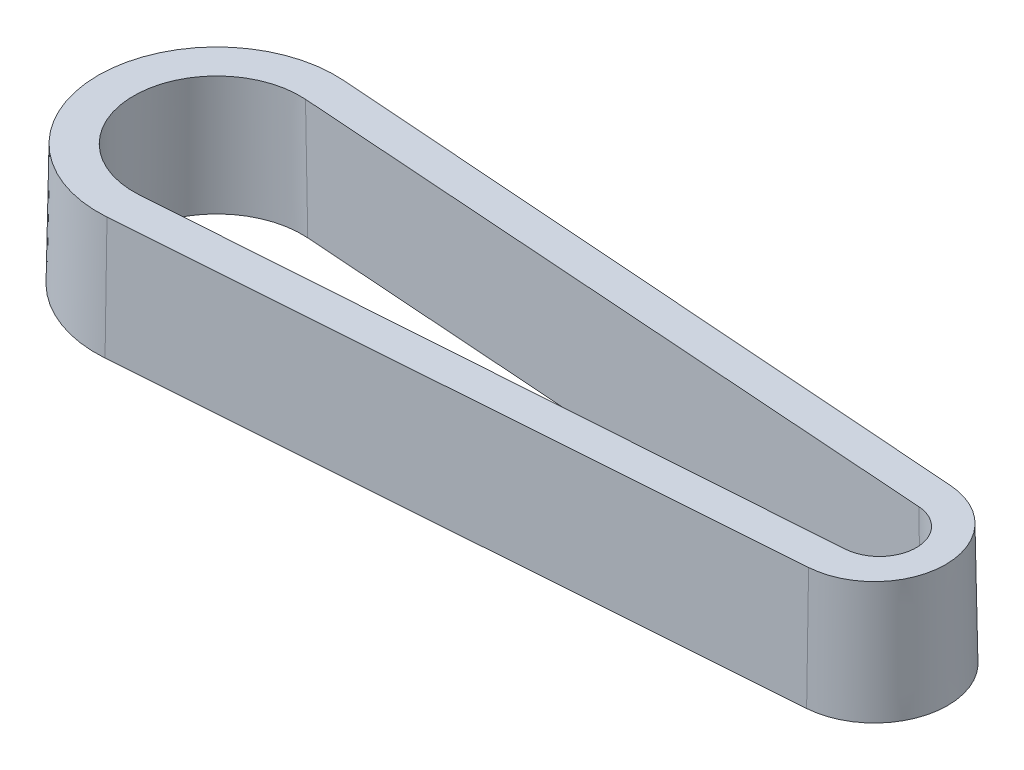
ISO-10303-21;
HEADER;
FILE_DESCRIPTION(('STEP AP214'),'2;1');
FILE_NAME('part.step','',(''),(''),'','','');
FILE_SCHEMA(('AUTOMOTIVE_DESIGN { 1 0 10303 214 1 1 1 1 }'));
ENDSEC;
DATA;
#1=APPLICATION_CONTEXT('core data for automotive mechanical design processes');
#2=APPLICATION_PROTOCOL_DEFINITION('international standard','automotive_design',2000,#1);
#3=PRODUCT_CONTEXT('',#1,'mechanical');
#4=PRODUCT('Part','Part','',(#3));
#5=PRODUCT_RELATED_PRODUCT_CATEGORY('part','',(#4));
#6=PRODUCT_DEFINITION_FORMATION('','',#4);
#7=PRODUCT_DEFINITION_CONTEXT('part definition',#1,'design');
#8=PRODUCT_DEFINITION('design','',#6,#7);
#9=PRODUCT_DEFINITION_SHAPE('','',#8);
#10=(LENGTH_UNIT() NAMED_UNIT(*) SI_UNIT(.MILLI.,.METRE.));
#11=(NAMED_UNIT(*) PLANE_ANGLE_UNIT() SI_UNIT($,.RADIAN.));
#12=(NAMED_UNIT(*) SI_UNIT($,.STERADIAN.) SOLID_ANGLE_UNIT());
#13=UNCERTAINTY_MEASURE_WITH_UNIT(LENGTH_MEASURE(1.E-05),#10,'distance_accuracy_value','');
#14=(GEOMETRIC_REPRESENTATION_CONTEXT(3) GLOBAL_UNCERTAINTY_ASSIGNED_CONTEXT((#13)) GLOBAL_UNIT_ASSIGNED_CONTEXT((#10,
#11,#12)) REPRESENTATION_CONTEXT('',''));
#15=CARTESIAN_POINT('',(0.,0.,0.));
#16=DIRECTION('',(0.,0.,1.));
#17=DIRECTION('',(1.,0.,0.));
#18=AXIS2_PLACEMENT_3D('',#15,#16,#17);
#19=CARTESIAN_POINT('',(0.,11.43,0.));
#20=DIRECTION('',(0.,1.,0.));
#21=DIRECTION('',(0.,0.,1.));
#22=AXIS2_PLACEMENT_3D('',#19,#20,#21);
#23=PLANE('',#22);
#24=CARTESIAN_POINT('',(0.,11.43,0.));
#25=DIRECTION('',(0.,1.,0.));
#26=DIRECTION('',(0.,0.,1.));
#27=AXIS2_PLACEMENT_3D('',#24,#25,#26);
#28=CIRCLE('',#27,11.2050886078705);
#29=CARTESIAN_POINT('',(0.808709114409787,11.43,-11.1758668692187));
#30=VERTEX_POINT('',#29);
#31=CARTESIAN_POINT('',(0.808709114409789,11.43,11.1758668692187));
#32=VERTEX_POINT('',#31);
#33=EDGE_CURVE('E80',#30,#32,#28,.T.);
#34=ORIENTED_EDGE('',*,*,#33,.T.);
#35=DIRECTION('',(-0.997392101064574,0.,0.0721733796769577));
#36=VECTOR('',#35,1.);
#37=CARTESIAN_POINT('',(0.808709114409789,11.43,11.1758668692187));
#38=LINE('',#37,#36);
#39=CARTESIAN_POINT('',(62.60084863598,11.43,6.70445834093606));
#40=VERTEX_POINT('',#39);
#41=EDGE_CURVE('E96',#32,#40,#38,.F.);
#42=ORIENTED_EDGE('',*,*,#41,.T.);
#43=CARTESIAN_POINT('',(62.1157,11.43,0.));
#44=DIRECTION('',(0.,1.,0.));
#45=DIRECTION('',(0.,0.,1.));
#46=AXIS2_PLACEMENT_3D('',#43,#44,#45);
#47=CIRCLE('',#46,6.72198860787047);
#48=CARTESIAN_POINT('',(62.60084863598,11.43,-6.70445834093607));
#49=VERTEX_POINT('',#48);
#50=EDGE_CURVE('E73',#40,#49,#47,.T.);
#51=ORIENTED_EDGE('',*,*,#50,.T.);
#52=DIRECTION('',(0.997392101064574,0.,0.0721733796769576));
#53=VECTOR('',#52,1.);
#54=CARTESIAN_POINT('',(0.808709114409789,11.43,-11.1758668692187));
#55=LINE('',#54,#53);
#56=EDGE_CURVE('E39',#49,#30,#55,.F.);
#57=ORIENTED_EDGE('',*,*,#56,.T.);
#58=EDGE_LOOP('',(#34,#42,#51,#57));
#59=FACE_BOUND('',#58,.T.);
#60=DIRECTION('',(0.997560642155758,0.,-0.0698051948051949));
#61=VECTOR('',#60,1.);
#62=CARTESIAN_POINT('',(0.54813053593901,11.43,7.83313406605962));
#63=LINE('',#62,#61);
#64=CARTESIAN_POINT('',(0.548130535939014,11.43,7.83313406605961));
#65=VERTEX_POINT('',#64);
#66=CARTESIAN_POINT('',(62.8287656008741,11.43,3.47499113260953));
#67=VERTEX_POINT('',#66);
#68=EDGE_CURVE('E122',#65,#67,#63,.T.);
#69=ORIENTED_EDGE('',*,*,#68,.F.);
#70=CARTESIAN_POINT('',(0.,11.43,0.));
#71=DIRECTION('',(0.,1.,0.));
#72=DIRECTION('',(0.,0.,1.));
#73=AXIS2_PLACEMENT_3D('',#70,#71,#72);
#74=CIRCLE('',#73,7.85228860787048);
#75=CARTESIAN_POINT('',(0.54813053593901,11.43,-7.83313406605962));
#76=VERTEX_POINT('',#75);
#77=EDGE_CURVE('E119',#76,#65,#74,.T.);
#78=ORIENTED_EDGE('',*,*,#77,.F.);
#79=DIRECTION('',(-0.997560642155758,0.,-0.0698051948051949));
#80=VECTOR('',#79,1.);
#81=CARTESIAN_POINT('',(0.54813053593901,11.43,-7.83313406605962));
#82=LINE('',#81,#80);
#83=CARTESIAN_POINT('',(62.8287656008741,11.43,-3.47499113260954));
#84=VERTEX_POINT('',#83);
#85=EDGE_CURVE('E108',#84,#76,#82,.T.);
#86=ORIENTED_EDGE('',*,*,#85,.F.);
#87=CARTESIAN_POINT('',(62.5856,11.43,0.));
#88=DIRECTION('',(0.,1.,0.));
#89=DIRECTION('',(0.,0.,1.));
#90=AXIS2_PLACEMENT_3D('',#87,#88,#89);
#91=CIRCLE('',#90,3.48348860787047);
#92=EDGE_CURVE('E118',#67,#84,#91,.T.);
#93=ORIENTED_EDGE('',*,*,#92,.F.);
#94=EDGE_LOOP('',(#69,#78,#86,#93));
#95=FACE_BOUND('',#94,.T.);
#96=ADVANCED_FACE('F35',(#59,#95),#23,.T.);
#97=CARTESIAN_POINT('',(0.,0.,0.));
#98=DIRECTION('',(0.,1.,0.));
#99=DIRECTION('',(0.,0.,1.));
#100=AXIS2_PLACEMENT_3D('',#97,#98,#99);
#101=PLANE('',#100);
#102=CARTESIAN_POINT('',(0.,0.,0.));
#103=DIRECTION('',(0.,1.,0.));
#104=DIRECTION('',(0.,0.,1.));
#105=AXIS2_PLACEMENT_3D('',#102,#103,#104);
#106=CIRCLE('',#105,11.4046);
#107=CARTESIAN_POINT('',(0.823108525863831,0.,-11.374857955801));
#108=VERTEX_POINT('',#107);
#109=CARTESIAN_POINT('',(0.823108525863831,0.,11.374857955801));
#110=VERTEX_POINT('',#109);
#111=EDGE_CURVE('E112',#108,#110,#106,.T.);
#112=ORIENTED_EDGE('',*,*,#111,.F.);
#113=DIRECTION('',(-0.997392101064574,0.,-0.0721733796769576));
#114=VECTOR('',#113,1.);
#115=CARTESIAN_POINT('',(0.823108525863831,0.,-11.374857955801));
#116=LINE('',#115,#114);
#117=CARTESIAN_POINT('',(62.6152480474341,0.,-6.90344942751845));
#118=VERTEX_POINT('',#117);
#119=EDGE_CURVE('E89',#118,#108,#116,.T.);
#120=ORIENTED_EDGE('',*,*,#119,.F.);
#121=CARTESIAN_POINT('',(62.1157,0.,0.));
#122=DIRECTION('',(0.,1.,0.));
#123=DIRECTION('',(0.,0.,1.));
#124=AXIS2_PLACEMENT_3D('',#121,#122,#123);
#125=CIRCLE('',#124,6.9215);
#126=CARTESIAN_POINT('',(62.6152480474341,0.,6.90344942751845));
#127=VERTEX_POINT('',#126);
#128=EDGE_CURVE('E99',#127,#118,#125,.T.);
#129=ORIENTED_EDGE('',*,*,#128,.F.);
#130=DIRECTION('',(0.997392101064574,0.,-0.0721733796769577));
#131=VECTOR('',#130,1.);
#132=CARTESIAN_POINT('',(0.823108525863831,0.,11.374857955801));
#133=LINE('',#132,#131);
#134=EDGE_CURVE('E129',#110,#127,#133,.T.);
#135=ORIENTED_EDGE('',*,*,#134,.F.);
#136=EDGE_LOOP('',(#112,#120,#129,#135));
#137=FACE_BOUND('',#136,.T.);
#138=CARTESIAN_POINT('',(0.,0.,0.));
#139=DIRECTION('',(0.,1.,0.));
#140=DIRECTION('',(0.,0.,1.));
#141=AXIS2_PLACEMENT_3D('',#138,#139,#140);
#142=CIRCLE('',#141,8.0518);
#143=CARTESIAN_POINT('',(0.562057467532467,0.,-8.03215877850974));
#144=VERTEX_POINT('',#143);
#145=CARTESIAN_POINT('',(0.562057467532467,0.,8.03215877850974));
#146=VERTEX_POINT('',#145);
#147=EDGE_CURVE('E141',#144,#146,#142,.T.);
#148=ORIENTED_EDGE('',*,*,#147,.T.);
#149=DIRECTION('',(0.997560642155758,0.,-0.0698051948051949));
#150=VECTOR('',#149,1.);
#151=CARTESIAN_POINT('',(0.562057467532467,0.,8.03215877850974));
#152=LINE('',#151,#150);
#153=CARTESIAN_POINT('',(62.8426925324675,0.,3.67401584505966));
#154=VERTEX_POINT('',#153);
#155=EDGE_CURVE('E138',#146,#154,#152,.T.);
#156=ORIENTED_EDGE('',*,*,#155,.T.);
#157=CARTESIAN_POINT('',(62.5856,0.,0.));
#158=DIRECTION('',(0.,1.,0.));
#159=DIRECTION('',(0.,0.,1.));
#160=AXIS2_PLACEMENT_3D('',#157,#158,#159);
#161=CIRCLE('',#160,3.683);
#162=CARTESIAN_POINT('',(62.8426925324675,0.,-3.67401584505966));
#163=VERTEX_POINT('',#162);
#164=EDGE_CURVE('E135',#154,#163,#161,.T.);
#165=ORIENTED_EDGE('',*,*,#164,.T.);
#166=DIRECTION('',(-0.997560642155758,0.,-0.0698051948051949));
#167=VECTOR('',#166,1.);
#168=CARTESIAN_POINT('',(0.562057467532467,0.,-8.03215877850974));
#169=LINE('',#168,#167);
#170=EDGE_CURVE('E123',#163,#144,#169,.T.);
#171=ORIENTED_EDGE('',*,*,#170,.T.);
#172=EDGE_LOOP('',(#148,#156,#165,#171));
#173=FACE_BOUND('',#172,.T.);
#174=ADVANCED_FACE('F145',(#137,#173),#101,.F.);
#175=CARTESIAN_POINT('',(0.,0.,0.));
#176=DIRECTION('',(0.,-1.,0.));
#177=DIRECTION('',(0.,0.,1.));
#178=AXIS2_PLACEMENT_3D('',#175,#176,#177);
#179=CONICAL_SURFACE('',#178,11.4046,0.0174532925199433);
#180=ORIENTED_EDGE('',*,*,#111,.T.);
#181=DIRECTION('',(0.00125959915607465,-0.999847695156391,0.0174068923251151));
#182=VECTOR('',#181,1.);
#183=CARTESIAN_POINT('',(0.823108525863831,0.,11.374857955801));
#184=LINE('',#183,#182);
#185=EDGE_CURVE('E11',#32,#110,#184,.T.);
#186=ORIENTED_EDGE('',*,*,#185,.F.);
#187=ORIENTED_EDGE('',*,*,#33,.F.);
#188=DIRECTION('',(0.00125959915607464,-0.999847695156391,-0.0174068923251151));
#189=VECTOR('',#188,1.);
#190=CARTESIAN_POINT('',(0.82310852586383,0.,-11.374857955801));
#191=LINE('',#190,#189);
#192=EDGE_CURVE('E84',#30,#108,#191,.T.);
#193=ORIENTED_EDGE('',*,*,#192,.T.);
#194=EDGE_LOOP('',(#180,#186,#187,#193));
#195=FACE_BOUND('',#194,.T.);
#196=ADVANCED_FACE('F95',(#195),#179,.T.);
#197=CARTESIAN_POINT('',(0.823108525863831,0.,11.374857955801));
#198=DIRECTION('',(0.0721623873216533,0.0174524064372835,0.997240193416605));
#199=DIRECTION('',(0.997392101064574,0.,-0.0721733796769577));
#200=AXIS2_PLACEMENT_3D('',#197,#198,#199);
#201=PLANE('',#200);
#202=ORIENTED_EDGE('',*,*,#134,.T.);
#203=DIRECTION('',(0.00125959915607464,-0.999847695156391,0.0174068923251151));
#204=VECTOR('',#203,1.);
#205=CARTESIAN_POINT('',(62.6152480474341,0.,6.90344942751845));
#206=LINE('',#205,#204);
#207=EDGE_CURVE('E45',#40,#127,#206,.T.);
#208=ORIENTED_EDGE('',*,*,#207,.F.);
#209=ORIENTED_EDGE('',*,*,#41,.F.);
#210=ORIENTED_EDGE('',*,*,#185,.T.);
#211=EDGE_LOOP('',(#202,#208,#209,#210));
#212=FACE_BOUND('',#211,.T.);
#213=ADVANCED_FACE('F37',(#212),#201,.T.);
#214=CARTESIAN_POINT('',(62.1157,0.,0.));
#215=DIRECTION('',(0.,-1.,0.));
#216=DIRECTION('',(0.,0.,1.));
#217=AXIS2_PLACEMENT_3D('',#214,#215,#216);
#218=CONICAL_SURFACE('',#217,6.9215,0.0174532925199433);
#219=ORIENTED_EDGE('',*,*,#128,.T.);
#220=DIRECTION('',(0.00125959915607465,-0.999847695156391,-0.0174068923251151));
#221=VECTOR('',#220,1.);
#222=CARTESIAN_POINT('',(62.6152480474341,0.,-6.90344942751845));
#223=LINE('',#222,#221);
#224=EDGE_CURVE('E93',#49,#118,#223,.T.);
#225=ORIENTED_EDGE('',*,*,#224,.F.);
#226=ORIENTED_EDGE('',*,*,#50,.F.);
#227=ORIENTED_EDGE('',*,*,#207,.T.);
#228=EDGE_LOOP('',(#219,#225,#226,#227));
#229=FACE_BOUND('',#228,.T.);
#230=ADVANCED_FACE('F180',(#229),#218,.T.);
#231=CARTESIAN_POINT('',(0.823108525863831,0.,-11.374857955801));
#232=DIRECTION('',(0.0721623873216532,0.0174524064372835,-0.997240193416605));
#233=DIRECTION('',(-0.997392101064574,0.,-0.0721733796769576));
#234=AXIS2_PLACEMENT_3D('',#231,#232,#233);
#235=PLANE('',#234);
#236=ORIENTED_EDGE('',*,*,#119,.T.);
#237=ORIENTED_EDGE('',*,*,#192,.F.);
#238=ORIENTED_EDGE('',*,*,#56,.F.);
#239=ORIENTED_EDGE('',*,*,#224,.T.);
#240=EDGE_LOOP('',(#236,#237,#238,#239));
#241=FACE_BOUND('',#240,.T.);
#242=ADVANCED_FACE('F87',(#241),#235,.T.);
#243=CARTESIAN_POINT('',(0.,0.,0.));
#244=DIRECTION('',(0.,-1.,0.));
#245=DIRECTION('',(0.,0.,1.));
#246=AXIS2_PLACEMENT_3D('',#243,#244,#245);
#247=CONICAL_SURFACE('',#246,8.0518,0.0174532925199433);
#248=ORIENTED_EDGE('',*,*,#147,.F.);
#249=DIRECTION('',(-0.00121826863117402,0.999847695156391,0.0174098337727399));
#250=VECTOR('',#249,1.);
#251=CARTESIAN_POINT('',(0.562057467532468,0.,-8.03215877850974));
#252=LINE('',#251,#250);
#253=EDGE_CURVE('E105',#76,#144,#252,.F.);
#254=ORIENTED_EDGE('',*,*,#253,.F.);
#255=ORIENTED_EDGE('',*,*,#77,.T.);
#256=DIRECTION('',(-0.00121826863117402,0.999847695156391,-0.0174098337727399));
#257=VECTOR('',#256,1.);
#258=CARTESIAN_POINT('',(0.562057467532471,0.,8.03215877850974));
#259=LINE('',#258,#257);
#260=EDGE_CURVE('E109',#65,#146,#259,.F.);
#261=ORIENTED_EDGE('',*,*,#260,.T.);
#262=EDGE_LOOP('',(#248,#254,#255,#261));
#263=FACE_BOUND('',#262,.T.);
#264=ADVANCED_FACE('F151',(#263),#247,.F.);
#265=CARTESIAN_POINT('',(0.562057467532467,0.,8.03215877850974));
#266=DIRECTION('',(-0.069794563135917,-0.0174524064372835,-0.997408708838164));
#267=DIRECTION('',(-0.997560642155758,0.,0.0698051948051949));
#268=AXIS2_PLACEMENT_3D('',#265,#266,#267);
#269=PLANE('',#268);
#270=ORIENTED_EDGE('',*,*,#155,.F.);
#271=ORIENTED_EDGE('',*,*,#260,.F.);
#272=ORIENTED_EDGE('',*,*,#68,.T.);
#273=DIRECTION('',(-0.00121826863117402,0.999847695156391,-0.0174098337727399));
#274=VECTOR('',#273,1.);
#275=CARTESIAN_POINT('',(62.8426925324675,0.,3.67401584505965));
#276=LINE('',#275,#274);
#277=EDGE_CURVE('E113',#67,#154,#276,.F.);
#278=ORIENTED_EDGE('',*,*,#277,.T.);
#279=EDGE_LOOP('',(#270,#271,#272,#278));
#280=FACE_BOUND('',#279,.T.);
#281=ADVANCED_FACE('F163',(#280),#269,.T.);
#282=CARTESIAN_POINT('',(62.5856,0.,0.));
#283=DIRECTION('',(0.,-1.,0.));
#284=DIRECTION('',(0.,0.,1.));
#285=AXIS2_PLACEMENT_3D('',#282,#283,#284);
#286=CONICAL_SURFACE('',#285,3.683,0.0174532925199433);
#287=ORIENTED_EDGE('',*,*,#164,.F.);
#288=ORIENTED_EDGE('',*,*,#277,.F.);
#289=ORIENTED_EDGE('',*,*,#92,.T.);
#290=DIRECTION('',(-0.001218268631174,0.999847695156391,0.0174098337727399));
#291=VECTOR('',#290,1.);
#292=CARTESIAN_POINT('',(62.8426925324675,0.,-3.67401584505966));
#293=LINE('',#292,#291);
#294=EDGE_CURVE('E54',#84,#163,#293,.F.);
#295=ORIENTED_EDGE('',*,*,#294,.T.);
#296=EDGE_LOOP('',(#287,#288,#289,#295));
#297=FACE_BOUND('',#296,.T.);
#298=ADVANCED_FACE('F168',(#297),#286,.F.);
#299=CARTESIAN_POINT('',(0.562057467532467,0.,-8.03215877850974));
#300=DIRECTION('',(-0.069794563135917,-0.0174524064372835,0.997408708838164));
#301=DIRECTION('',(0.997560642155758,0.,0.0698051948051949));
#302=AXIS2_PLACEMENT_3D('',#299,#300,#301);
#303=PLANE('',#302);
#304=ORIENTED_EDGE('',*,*,#170,.F.);
#305=ORIENTED_EDGE('',*,*,#294,.F.);
#306=ORIENTED_EDGE('',*,*,#85,.T.);
#307=ORIENTED_EDGE('',*,*,#253,.T.);
#308=EDGE_LOOP('',(#304,#305,#306,#307));
#309=FACE_BOUND('',#308,.T.);
#310=ADVANCED_FACE('F154',(#309),#303,.T.);
#311=CLOSED_SHELL('',(#96,#174,#196,#213,#230,#242,#264,#281,#298,#310));
#312=MANIFOLD_SOLID_BREP('B2',#311);
#313=ADVANCED_BREP_SHAPE_REPRESENTATION('',(#18,#312),#14);
#314=SHAPE_DEFINITION_REPRESENTATION(#9,#313);
ENDSEC;
END-ISO-10303-21;
